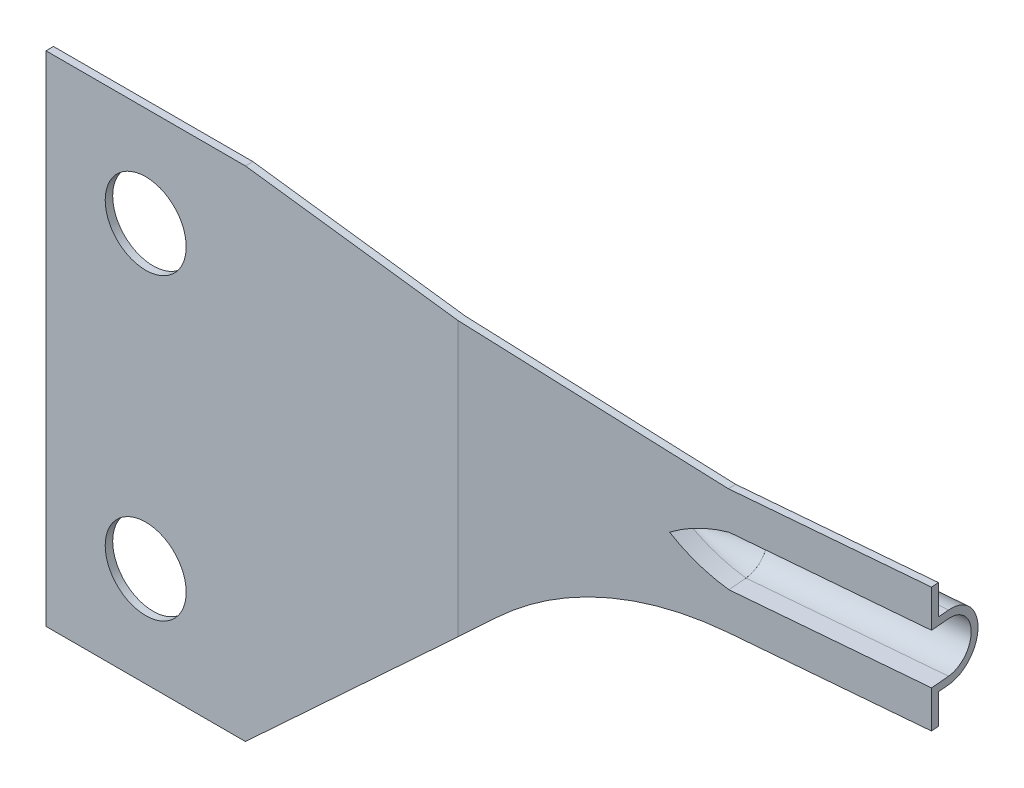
from build123d import *

# Parameters (mm, degrees)
ESQUISSE2_R                  = 3.25
BASE_EXTRUSION_DEPTH         = 10
ENL_V_MAT_EXTRU_2_DEPTH      = 80.523581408
ENL_V_MAT_EXTRU_4_DEPTH      = 74.205464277
BOSS_EXTRU_1_DEPTH           = 15
ESQUISSE13_W                 = 0.597716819
ESQUISSE13_H                 = 4
ENL_V_MAT_EXTRU_10_DEPTH     = 15
BOSS_R_VOL_2_ANGLE           = 90
R_P_TITION_CIRCULAIRE2_COUNT = 2
R_P_TITION_CIRCULAIRE2_ANGLE = 90
ENL_V_MAT_EXTRU_11_REACH     = 80.56
BOSS_EXTRU_4_REACH           = 80.532


with BuildPart() as part:
    # Esquisse2 → Base-Extrusion (new body)
    with BuildSketch(Plane.XY):
        with BuildLine():
            Line((0, 0), (16, 0))
            Line((16, 0), (36.008980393, 18.53862734))
            ThreePointArc((36.008980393, 18.53862734), (43.874915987, 23.475155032), (53, 25.2))
            Line((53, 25.2), (68, 25.2))
            Line((68, 25.2), (68, 35.2))
            Line((68, 35.2), (53, 35.2))
            Line((53, 35.2), (16, 40))
            Line((16, 40), (0, 40))
            Line((0, 40), (0, 0))
        make_face()
        with Locations(Location((8, 32, 0), (0, 0, 180))):
            Circle(ESQUISSE2_R, mode=Mode.SUBTRACT)
        with Locations(Location((8, 8, 0), (0, 0, 180))):
            Circle(ESQUISSE2_R, mode=Mode.SUBTRACT)
    extrude(amount=BASE_EXTRUSION_DEPTH)

    # Esquisse3 → Enl_v. mat.-Extru.2 (cut, through all)
    with BuildSketch(Plane(origin=(0, 0, 0), x_dir=(1, 0, 0), z_dir=(0, 1, 0))):
        Polygon((-11.405598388, -10), (33.076363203, -10), (71.342209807, -6.652172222), (73.022460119, -25.85752117), (10.240200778, -30.630397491), (-14.947793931, -16.170018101), align=None)
        Polygon((70.111206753, 7.418257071), (71.290115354, -6.056729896), (33.076363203, -9.4), (-11.061139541, -9.4), (0.076363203, 10), align=None)
    extrude(amount=ENL_V_MAT_EXTRU_2_DEPTH, mode=Mode.SUBTRACT)

    # Esquisse4 → Enl_v. mat.-Extru.4 (cut, through all)
    with BuildSketch(Plane.XZ.offset(-25.2)):
        Polygon((68, 6.944577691), (67.783058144, 4.464920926), (68.445561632, 6.905596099), align=None)
    extrude(amount=-ENL_V_MAT_EXTRU_4_DEPTH, mode=Mode.SUBTRACT)

    # Esquisse5 → Boss.-Extru.1 (add)
    with BuildSketch(Plane(origin=(66.880506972, 0, -5.851286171), x_dir=(-0.08715574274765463, 0, -0.9961946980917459), z_dir=(0.9961946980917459, 0, -0.08715574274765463))):
        with BuildLine():
            Line((-12.247025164, 28.2), (-12.247025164, 27.6))
            Line((-12.247025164, 27.6), (-11.344741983, 27.6))
            ThreePointArc((-11.344741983, 27.6), (-8.744741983, 30.2), (-11.344741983, 32.8))
            Line((-11.344741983, 32.8), (-12.247025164, 32.8))
            Line((-12.247025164, 32.8), (-12.247025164, 32.2))
            Line((-12.247025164, 32.2), (-11.344741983, 32.2))
            ThreePointArc((-11.344741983, 32.2), (-9.344741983, 30.2), (-11.344741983, 28.2))
            Line((-11.344741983, 28.2), (-12.247025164, 28.2))
        make_face()
    extrude(amount=-BOSS_EXTRU_1_DEPTH)

    # Esquisse13 → Enl_v. mat.-Extru.10 (cut)
    with BuildSketch(Plane(origin=(66.880506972, 0, -5.851286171), x_dir=(-0.08715574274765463, 0, -0.9961946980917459), z_dir=(0.9961946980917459, 0, -0.08715574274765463))):
        with Locations((-12.545883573, 30.2)):
            Rectangle(ESQUISSE13_W, ESQUISSE13_H)
    extrude(amount=-ENL_V_MAT_EXTRU_10_DEPTH, mode=Mode.SUBTRACT)

    # Esquisse14 → Boss.-R_vol.2 (revolve)
    with BuildSketch(Plane(origin=(0, 30.2, 0), x_dir=(-1, 0, 0), z_dir=(0, 1, 0))):
        with BuildLine():
            Line((-52.699895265, 4.169279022), (-52.752188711, 4.76699584))
            ThreePointArc((-52.752188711, 4.76699584), (-50.520750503, 5.729088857), (-48.543089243, 7.141107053))
            Line((-48.543089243, 7.141107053), (-47.945372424, 7.193400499))
            ThreePointArc((-47.945372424, 7.193400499), (-50.153447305, 5.415344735), (-52.699895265, 4.169279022))
        make_face()
    boss_r_vol_2 = revolve(axis=Axis((56.386736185, 30.2, 6.454876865), (0.9961946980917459, 0, -0.08715574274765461)), revolution_arc=BOSS_R_VOL_2_ANGLE)

    # R_p_tition circulaire2: Boss.-R_vol.2 ×2 about axis
    r_p_tition_circulaire2_axis = Axis((56.386736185, 30.2, 6.454876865), (-0.9961946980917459, 0, 0.08715574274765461))
    for i in range(1, R_P_TITION_CIRCULAIRE2_COUNT):
        add(boss_r_vol_2.rotate(r_p_tition_circulaire2_axis, i * R_P_TITION_CIRCULAIRE2_ANGLE / (R_P_TITION_CIRCULAIRE2_COUNT - 1)))

    # Esquisse15 → Enl_v. mat.-Extru.11 (cut, up to next)
    with BuildSketch(Plane(origin=(1.119493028, 0, 12.795863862), x_dir=(0.9961946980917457, 0, -0.08715574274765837), z_dir=(0.08715574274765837, 0, 0.9961946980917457)), mode=Mode.PRIVATE) as enl_v_mat_extru_11_sk1:
        with BuildLine():
            Line((52.135979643, 32.198229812), (52.135979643, 28.201770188))
            ThreePointArc((52.135979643, 28.201770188), (49.8291808, 28.965719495), (47.735979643, 30.2))
            ThreePointArc((47.735979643, 30.2), (49.8291808, 31.434280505), (52.135979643, 32.198229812))
        make_face()
    enl_v_mat_extru_11_tool1 = extrude(enl_v_mat_extru_11_sk1.sketch, amount=-ENL_V_MAT_EXTRU_11_REACH, mode=Mode.PRIVATE) & part.part
    add(enl_v_mat_extru_11_tool1.solids().sort_by_distance((51.472709, 30.2, 8.390528))[0], mode=Mode.SUBTRACT)

    # Esquisse17 → Boss.-Extru.4 (add, up to next)
    with BuildSketch(Plane(origin=(1.067398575, 0, 12.200421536), x_dir=(-0.9961946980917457, 0, 0.08715574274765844), z_dir=(-0.08715574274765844, 0, -0.9961946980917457)), mode=Mode.PRIVATE) as boss_extru_4_sk1:
        with BuildLine():
            Line((-52.135979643, 32.798229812), (-52.135979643, 32.198229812))
            ThreePointArc((-52.135979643, 32.198229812), (-49.8291808, 31.434280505), (-47.735979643, 30.2))
            ThreePointArc((-47.735979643, 30.2), (-49.8291808, 28.965719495), (-52.135979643, 28.201770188))
            Line((-52.135979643, 28.201770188), (-52.135979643, 27.601770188))
            ThreePointArc((-52.135979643, 27.601770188), (-49.490619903, 28.621156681), (-47.135979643, 30.2))
            ThreePointArc((-47.135979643, 30.2), (-49.490619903, 31.778843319), (-52.135979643, 32.798229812))
        make_face()
    boss_extru_4_tool1 = extrude(boss_extru_4_sk1.sketch, amount=BOSS_EXTRU_4_REACH, mode=Mode.PRIVATE) - part.part
    add(boss_extru_4_tool1.solids().sort_by_distance((50.402817, 31.714854, 7.884132))[0])


solid = part.part
